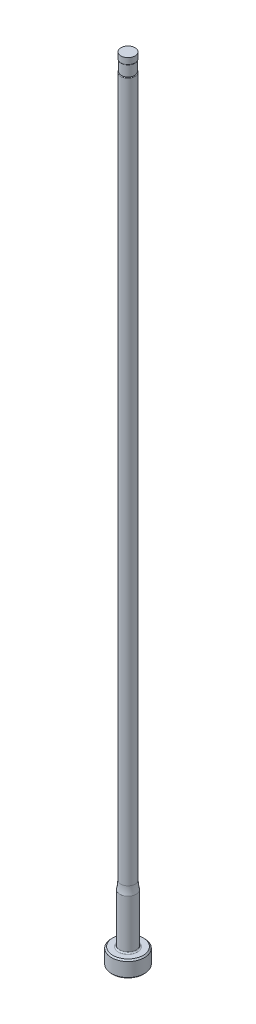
ISO-10303-21;
HEADER;
FILE_DESCRIPTION(('STEP AP214'),'2;1');
FILE_NAME('part.step','',(''),(''),'','','');
FILE_SCHEMA(('AUTOMOTIVE_DESIGN { 1 0 10303 214 1 1 1 1 }'));
ENDSEC;
DATA;
#1=APPLICATION_CONTEXT('core data for automotive mechanical design processes');
#2=APPLICATION_PROTOCOL_DEFINITION('international standard','automotive_design',2000,#1);
#3=PRODUCT_CONTEXT('',#1,'mechanical');
#4=PRODUCT('Part','Part','',(#3));
#5=PRODUCT_RELATED_PRODUCT_CATEGORY('part','',(#4));
#6=PRODUCT_DEFINITION_FORMATION('','',#4);
#7=PRODUCT_DEFINITION_CONTEXT('part definition',#1,'design');
#8=PRODUCT_DEFINITION('design','',#6,#7);
#9=PRODUCT_DEFINITION_SHAPE('','',#8);
#10=(LENGTH_UNIT() NAMED_UNIT(*) SI_UNIT(.MILLI.,.METRE.));
#11=(NAMED_UNIT(*) PLANE_ANGLE_UNIT() SI_UNIT($,.RADIAN.));
#12=(NAMED_UNIT(*) SI_UNIT($,.STERADIAN.) SOLID_ANGLE_UNIT());
#13=UNCERTAINTY_MEASURE_WITH_UNIT(LENGTH_MEASURE(1.E-05),#10,'distance_accuracy_value','');
#14=(GEOMETRIC_REPRESENTATION_CONTEXT(3) GLOBAL_UNCERTAINTY_ASSIGNED_CONTEXT((#13)) GLOBAL_UNIT_ASSIGNED_CONTEXT((#10,
#11,#12)) REPRESENTATION_CONTEXT('',''));
#15=CARTESIAN_POINT('',(0.,0.,0.));
#16=DIRECTION('',(0.,0.,1.));
#17=DIRECTION('',(1.,0.,0.));
#18=AXIS2_PLACEMENT_3D('',#15,#16,#17);
#19=CARTESIAN_POINT('',(0.,259.958771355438,0.));
#20=DIRECTION('',(0.,1.,0.));
#21=DIRECTION('',(0.,0.,1.));
#22=AXIS2_PLACEMENT_3D('',#19,#20,#21);
#23=CYLINDRICAL_SURFACE('',#22,1.38810999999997);
#24=DIRECTION('',(0.,1.,0.));
#25=VECTOR('',#24,1.);
#26=CARTESIAN_POINT('',(-1.28650999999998,259.958771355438,-0.521288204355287));
#27=LINE('',#26,#25);
#28=CARTESIAN_POINT('',(-1.28650999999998,148.973565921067,-0.521288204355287));
#29=VERTEX_POINT('',#28);
#30=CARTESIAN_POINT('',(-1.28650999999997,112.014,-0.521288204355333));
#31=VERTEX_POINT('',#30);
#32=EDGE_CURVE('E66',#29,#31,#27,.F.);
#33=ORIENTED_EDGE('',*,*,#32,.F.);
#34=CARTESIAN_POINT('',(0.,148.973565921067,0.));
#35=DIRECTION('',(0.,1.,0.));
#36=DIRECTION('',(0.,0.,1.));
#37=AXIS2_PLACEMENT_3D('',#34,#35,#36);
#38=CIRCLE('',#37,1.38810999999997);
#39=CARTESIAN_POINT('',(-1.28650999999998,148.973565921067,0.521288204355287));
#40=VERTEX_POINT('',#39);
#41=EDGE_CURVE('E44',#29,#40,#38,.F.);
#42=ORIENTED_EDGE('',*,*,#41,.T.);
#43=DIRECTION('',(0.,1.,0.));
#44=VECTOR('',#43,1.);
#45=CARTESIAN_POINT('',(-1.28650999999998,259.958771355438,0.521288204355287));
#46=LINE('',#45,#44);
#47=CARTESIAN_POINT('',(-1.28650999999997,112.014,0.521288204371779));
#48=VERTEX_POINT('',#47);
#49=EDGE_CURVE('E72',#48,#40,#46,.T.);
#50=ORIENTED_EDGE('',*,*,#49,.F.);
#51=CARTESIAN_POINT('',(-1.28650999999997,112.014,-0.521288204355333));
#52=CARTESIAN_POINT('',(-1.28650942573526,111.988928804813,-0.521284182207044));
#53=CARTESIAN_POINT('',(-1.28680726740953,111.963865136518,-0.520555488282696));
#54=CARTESIAN_POINT('',(-1.28799191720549,111.913826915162,-0.517619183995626));
#55=CARTESIAN_POINT('',(-1.28887900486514,111.888852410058,-0.515410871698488));
#56=CARTESIAN_POINT('',(-1.29243982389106,111.813619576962,-0.506452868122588));
#57=CARTESIAN_POINT('',(-1.29601290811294,111.763650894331,-0.49736839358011));
#58=CARTESIAN_POINT('',(-1.30530992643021,111.665479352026,-0.472434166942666));
#59=CARTESIAN_POINT('',(-1.31103961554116,111.617281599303,-0.456566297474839));
#60=CARTESIAN_POINT('',(-1.32412375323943,111.524513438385,-0.417110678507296));
#61=CARTESIAN_POINT('',(-1.33146964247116,111.479925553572,-0.393563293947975));
#62=CARTESIAN_POINT('',(-1.34350828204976,111.414593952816,-0.349438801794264));
#63=CARTESIAN_POINT('',(-1.34799903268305,111.391780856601,-0.331865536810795));
#64=CARTESIAN_POINT('',(-1.35686421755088,111.34896367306,-0.29352417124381));
#65=CARTESIAN_POINT('',(-1.36123876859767,111.328956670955,-0.272759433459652));
#66=CARTESIAN_POINT('',(-1.36869665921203,111.296112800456,-0.232084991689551));
#67=CARTESIAN_POINT('',(-1.37186978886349,111.282633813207,-0.212714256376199));
#68=CARTESIAN_POINT('',(-1.37757131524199,111.25895318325,-0.171955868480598));
#69=CARTESIAN_POINT('',(-1.38010004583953,111.248749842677,-0.150569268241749));
#70=CARTESIAN_POINT('',(-1.38424028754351,111.232264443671,-0.105984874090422));
#71=CARTESIAN_POINT('',(-1.38584269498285,111.226021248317,-0.0827715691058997));
#72=CARTESIAN_POINT('',(-1.3878558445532,111.218203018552,-0.0355242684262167));
#73=CARTESIAN_POINT('',(-1.38826785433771,111.216623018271,-0.0114911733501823));
#74=CARTESIAN_POINT('',(-1.38787374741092,111.218145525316,0.0326639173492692));
#75=CARTESIAN_POINT('',(-1.38724652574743,111.220560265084,0.0528147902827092));
#76=CARTESIAN_POINT('',(-1.38517272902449,111.228639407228,0.0924056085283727));
#77=CARTESIAN_POINT('',(-1.38372605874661,111.234304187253,0.111845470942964));
#78=CARTESIAN_POINT('',(-1.38015682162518,111.248532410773,0.149590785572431));
#79=CARTESIAN_POINT('',(-1.37803307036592,111.257100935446,0.167894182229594));
#80=CARTESIAN_POINT('',(-1.37329208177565,111.276682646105,0.203060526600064));
#81=CARTESIAN_POINT('',(-1.3706746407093,111.287696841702,0.219922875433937));
#82=CARTESIAN_POINT('',(-1.36363743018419,111.318179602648,0.260714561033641));
#83=CARTESIAN_POINT('',(-1.35900359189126,111.339015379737,0.283587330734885));
#84=CARTESIAN_POINT('',(-1.34954115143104,111.384071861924,0.325660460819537));
#85=CARTESIAN_POINT('',(-1.34471211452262,111.408300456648,0.344852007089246));
#86=CARTESIAN_POINT('',(-1.3331073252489,111.470742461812,0.387781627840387));
#87=CARTESIAN_POINT('',(-1.32644843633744,111.510293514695,0.409600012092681));
#88=CARTESIAN_POINT('',(-1.31433631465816,111.592492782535,0.446935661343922));
#89=CARTESIAN_POINT('',(-1.3088875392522,111.635151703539,0.462429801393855));
#90=CARTESIAN_POINT('',(-1.29848168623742,111.733173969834,0.491004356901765));
#91=CARTESIAN_POINT('',(-1.29398787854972,111.789047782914,0.50251359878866));
#92=CARTESIAN_POINT('',(-1.2895011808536,111.873377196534,0.513856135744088));
#93=CARTESIAN_POINT('',(-1.28838136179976,111.901428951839,0.516650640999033));
#94=CARTESIAN_POINT('',(-1.28688584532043,111.957649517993,0.520362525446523));
#95=CARTESIAN_POINT('',(-1.28650943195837,111.985818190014,0.521281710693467));
#96=CARTESIAN_POINT('',(-1.28650999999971,112.013999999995,0.521288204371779));
#97=B_SPLINE_CURVE_WITH_KNOTS('',3,(#51,#52,#53,#54,#55,#56,#57,#58,#59,#60,#61,#62,#63,#64,#65,
#66,#67,#68,#69,#70,#71,#72,#73,#74,#75,#76,#77,#78,#79,#80,#81,#82,#83,#84,#85,#86,#87,#88,#89,
#90,#91,#92,#93,#94,#95,#96),.UNSPECIFIED.,.F.,.F.,(4,2,2,2,2,2,2,2,2,2,2,2,2,2,2,2,2,2,2,2,2,2,
4),(0.,0.0751855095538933,0.15040671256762,0.30263293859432,0.455268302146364,0.607113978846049,
0.694309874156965,0.781414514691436,0.852578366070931,0.923705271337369,0.99551980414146,
1.06725783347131,1.12787752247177,1.18850425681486,1.2492376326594,1.30999612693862,
1.40332110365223,1.49686681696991,1.63308593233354,1.76979877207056,1.94068119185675,
2.02526314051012,2.10976359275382),.UNSPECIFIED.);
#98=EDGE_CURVE('E74',#31,#48,#97,.T.);
#99=ORIENTED_EDGE('',*,*,#98,.F.);
#100=EDGE_LOOP('',(#33,#42,#50,#99));
#101=FACE_BOUND('',#100,.T.);
#102=CARTESIAN_POINT('',(0.,14.2787642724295,0.));
#103=DIRECTION('',(0.,1.,0.));
#104=DIRECTION('',(0.,0.,1.));
#105=AXIS2_PLACEMENT_3D('',#102,#103,#104);
#106=CIRCLE('',#105,1.38810999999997);
#107=CARTESIAN_POINT('',(0.,14.2787642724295,1.38810999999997));
#108=VERTEX_POINT('',#107);
#109=EDGE_CURVE('E95',#108,#108,#106,.T.);
#110=ORIENTED_EDGE('',*,*,#109,.T.);
#111=EDGE_LOOP('',(#110));
#112=FACE_BOUND('',#111,.T.);
#113=ADVANCED_FACE('F36',(#101,#112),#23,.T.);
#114=CARTESIAN_POINT('',(0.,14.2787642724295,0.));
#115=DIRECTION('',(0.,1.,0.));
#116=DIRECTION('',(0.,0.,1.));
#117=AXIS2_PLACEMENT_3D('',#114,#115,#116);
#118=TOROIDAL_SURFACE('',#117,7.73810999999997,6.35);
#119=CARTESIAN_POINT('',(0.,12.7,0.));
#120=DIRECTION('',(0.,1.,0.));
#121=DIRECTION('',(0.,0.,1.));
#122=AXIS2_PLACEMENT_3D('',#119,#120,#121);
#123=CIRCLE('',#122,1.58749999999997);
#124=CARTESIAN_POINT('',(0.,12.7,1.58749999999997));
#125=VERTEX_POINT('',#124);
#126=EDGE_CURVE('E92',#125,#125,#123,.T.);
#127=ORIENTED_EDGE('',*,*,#126,.T.);
#128=EDGE_LOOP('',(#127));
#129=FACE_BOUND('',#128,.T.);
#130=ORIENTED_EDGE('',*,*,#109,.F.);
#131=EDGE_LOOP('',(#130));
#132=FACE_BOUND('',#131,.T.);
#133=ADVANCED_FACE('F156',(#129,#132),#118,.F.);
#134=CARTESIAN_POINT('',(0.,259.958771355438,0.));
#135=DIRECTION('',(0.,1.,0.));
#136=DIRECTION('',(0.,0.,1.));
#137=AXIS2_PLACEMENT_3D('',#134,#135,#136);
#138=CYLINDRICAL_SURFACE('',#137,1.58749999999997);
#139=CARTESIAN_POINT('',(0.,3.42900000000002,0.));
#140=DIRECTION('',(0.,1.,0.));
#141=DIRECTION('',(0.,0.,1.));
#142=AXIS2_PLACEMENT_3D('',#139,#140,#141);
#143=CIRCLE('',#142,1.58749999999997);
#144=CARTESIAN_POINT('',(0.,3.42900000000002,1.58749999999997));
#145=VERTEX_POINT('',#144);
#146=EDGE_CURVE('E110',#145,#145,#143,.T.);
#147=ORIENTED_EDGE('',*,*,#146,.T.);
#148=EDGE_LOOP('',(#147));
#149=FACE_BOUND('',#148,.T.);
#150=ORIENTED_EDGE('',*,*,#126,.F.);
#151=EDGE_LOOP('',(#150));
#152=FACE_BOUND('',#151,.T.);
#153=ADVANCED_FACE('F153',(#149,#152),#138,.T.);
#154=CARTESIAN_POINT('',(-3.17499999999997,3.175,0.));
#155=DIRECTION('',(0.,1.,0.));
#156=DIRECTION('',(0.,0.,1.));
#157=AXIS2_PLACEMENT_3D('',#154,#155,#156);
#158=PLANE('',#157);
#159=CARTESIAN_POINT('',(0.,3.175,0.));
#160=DIRECTION('',(0.,1.,0.));
#161=DIRECTION('',(0.,0.,1.));
#162=AXIS2_PLACEMENT_3D('',#159,#160,#161);
#163=CIRCLE('',#162,1.84149999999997);
#164=CARTESIAN_POINT('',(0.,3.175,1.84149999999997));
#165=VERTEX_POINT('',#164);
#166=EDGE_CURVE('E78',#165,#165,#163,.F.);
#167=ORIENTED_EDGE('',*,*,#166,.T.);
#168=EDGE_LOOP('',(#167));
#169=FACE_BOUND('',#168,.T.);
#170=CARTESIAN_POINT('',(0.,3.175,0.));
#171=DIRECTION('',(0.,1.,0.));
#172=DIRECTION('',(0.,0.,1.));
#173=AXIS2_PLACEMENT_3D('',#170,#171,#172);
#174=CIRCLE('',#173,2.92099999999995);
#175=CARTESIAN_POINT('',(0.,3.175,2.92099999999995));
#176=VERTEX_POINT('',#175);
#177=EDGE_CURVE('E98',#176,#176,#174,.T.);
#178=ORIENTED_EDGE('',*,*,#177,.T.);
#179=EDGE_LOOP('',(#178));
#180=FACE_BOUND('',#179,.T.);
#181=ADVANCED_FACE('F149',(#169,#180),#158,.T.);
#182=CARTESIAN_POINT('',(0.,259.958771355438,0.));
#183=DIRECTION('',(0.,1.,0.));
#184=DIRECTION('',(0.,0.,1.));
#185=AXIS2_PLACEMENT_3D('',#182,#183,#184);
#186=CYLINDRICAL_SURFACE('',#185,3.17499999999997);
#187=CARTESIAN_POINT('',(0.,2.92100000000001,0.));
#188=DIRECTION('',(0.,1.,0.));
#189=DIRECTION('',(0.,0.,1.));
#190=AXIS2_PLACEMENT_3D('',#187,#188,#189);
#191=CIRCLE('',#190,3.17499999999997);
#192=CARTESIAN_POINT('',(0.,2.92100000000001,3.17499999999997));
#193=VERTEX_POINT('',#192);
#194=EDGE_CURVE('E104',#193,#193,#191,.F.);
#195=ORIENTED_EDGE('',*,*,#194,.T.);
#196=EDGE_LOOP('',(#195));
#197=FACE_BOUND('',#196,.T.);
#198=CARTESIAN_POINT('',(0.,0.254000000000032,0.));
#199=DIRECTION('',(0.,-1.,0.));
#200=DIRECTION('',(0.,0.,-1.));
#201=AXIS2_PLACEMENT_3D('',#198,#199,#200);
#202=CIRCLE('',#201,3.17499999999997);
#203=CARTESIAN_POINT('',(0.,0.254000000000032,-3.17499999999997));
#204=VERTEX_POINT('',#203);
#205=EDGE_CURVE('E101',#204,#204,#202,.F.);
#206=ORIENTED_EDGE('',*,*,#205,.T.);
#207=EDGE_LOOP('',(#206));
#208=FACE_BOUND('',#207,.T.);
#209=ADVANCED_FACE('F145',(#197,#208),#186,.T.);
#210=CARTESIAN_POINT('',(0.,0.,0.));
#211=DIRECTION('',(0.,-1.,0.));
#212=DIRECTION('',(0.,0.,-1.));
#213=AXIS2_PLACEMENT_3D('',#210,#211,#212);
#214=PLANE('',#213);
#215=CARTESIAN_POINT('',(0.,0.,0.));
#216=DIRECTION('',(0.,-1.,0.));
#217=DIRECTION('',(0.,0.,-1.));
#218=AXIS2_PLACEMENT_3D('',#215,#216,#217);
#219=CIRCLE('',#218,2.92099999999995);
#220=CARTESIAN_POINT('',(0.,0.,-2.92099999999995));
#221=VERTEX_POINT('',#220);
#222=EDGE_CURVE('E107',#221,#221,#219,.T.);
#223=ORIENTED_EDGE('',*,*,#222,.T.);
#224=EDGE_LOOP('',(#223));
#225=FACE_BOUND('',#224,.T.);
#226=ADVANCED_FACE('F141',(#225),#214,.T.);
#227=CARTESIAN_POINT('',(0.,3.17499999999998,0.));
#228=DIRECTION('',(0.,-1.,0.));
#229=DIRECTION('',(0.,0.,-1.));
#230=AXIS2_PLACEMENT_3D('',#227,#228,#229);
#231=CONICAL_SURFACE('',#230,2.92099999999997,0.7853981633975);
#232=ORIENTED_EDGE('',*,*,#194,.F.);
#233=EDGE_LOOP('',(#232));
#234=FACE_BOUND('',#233,.T.);
#235=ORIENTED_EDGE('',*,*,#177,.F.);
#236=EDGE_LOOP('',(#235));
#237=FACE_BOUND('',#236,.T.);
#238=ADVANCED_FACE('F144',(#234,#237),#231,.T.);
#239=CARTESIAN_POINT('',(0.,0.254000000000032,0.));
#240=DIRECTION('',(0.,1.,0.));
#241=DIRECTION('',(0.,0.,1.));
#242=AXIS2_PLACEMENT_3D('',#239,#240,#241);
#243=CONICAL_SURFACE('',#242,3.17499999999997,0.785398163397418);
#244=ORIENTED_EDGE('',*,*,#222,.F.);
#245=EDGE_LOOP('',(#244));
#246=FACE_BOUND('',#245,.T.);
#247=ORIENTED_EDGE('',*,*,#205,.F.);
#248=EDGE_LOOP('',(#247));
#249=FACE_BOUND('',#248,.T.);
#250=ADVANCED_FACE('F245',(#246,#249),#243,.T.);
#251=CARTESIAN_POINT('',(0.,3.42900000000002,0.));
#252=DIRECTION('',(0.,1.,0.));
#253=DIRECTION('',(0.,0.,1.));
#254=AXIS2_PLACEMENT_3D('',#251,#252,#253);
#255=TOROIDAL_SURFACE('',#254,1.84149999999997,0.254);
#256=ORIENTED_EDGE('',*,*,#166,.F.);
#257=EDGE_LOOP('',(#256));
#258=FACE_BOUND('',#257,.T.);
#259=ORIENTED_EDGE('',*,*,#146,.F.);
#260=EDGE_LOOP('',(#259));
#261=FACE_BOUND('',#260,.T.);
#262=ADVANCED_FACE('F139',(#258,#261),#255,.F.);
#263=CARTESIAN_POINT('',(0.,153.448281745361,0.));
#264=DIRECTION('',(0.,1.,0.));
#265=DIRECTION('',(0.,0.,1.));
#266=AXIS2_PLACEMENT_3D('',#263,#264,#265);
#267=CYLINDRICAL_SURFACE('',#266,1.28650999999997);
#268=CARTESIAN_POINT('',(0.,151.13,0.));
#269=DIRECTION('',(0.,1.,0.));
#270=DIRECTION('',(0.,0.,1.));
#271=AXIS2_PLACEMENT_3D('',#268,#269,#270);
#272=CIRCLE('',#271,1.28650999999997);
#273=CARTESIAN_POINT('',(0.,151.13,1.28650999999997));
#274=VERTEX_POINT('',#273);
#275=EDGE_CURVE('E71',#274,#274,#272,.T.);
#276=ORIENTED_EDGE('',*,*,#275,.F.);
#277=EDGE_LOOP('',(#276));
#278=FACE_BOUND('',#277,.T.);
#279=CARTESIAN_POINT('',(0.,149.098,0.));
#280=DIRECTION('',(0.,1.,0.));
#281=DIRECTION('',(0.,0.,1.));
#282=AXIS2_PLACEMENT_3D('',#279,#280,#281);
#283=CIRCLE('',#282,1.28650999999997);
#284=CARTESIAN_POINT('',(-1.28650999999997,149.098,0.));
#285=VERTEX_POINT('',#284);
#286=EDGE_CURVE('E89',#285,#285,#283,.T.);
#287=ORIENTED_EDGE('',*,*,#286,.T.);
#288=EDGE_LOOP('',(#287));
#289=FACE_BOUND('',#288,.T.);
#290=ADVANCED_FACE('F136',(#278,#289),#267,.T.);
#291=CARTESIAN_POINT('',(-1.28650999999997,150.114,-3.17499999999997));
#292=DIRECTION('',(1.,0.,0.));
#293=DIRECTION('',(0.,1.,0.));
#294=AXIS2_PLACEMENT_3D('',#291,#292,#293);
#295=PLANE('',#294);
#296=CARTESIAN_POINT('',(-1.28650999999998,148.973565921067,0.521288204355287));
#297=CARTESIAN_POINT('',(-1.28650999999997,148.976543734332,0.521296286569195));
#298=CARTESIAN_POINT('',(-1.28650999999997,148.97951092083,0.521009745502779));
#299=CARTESIAN_POINT('',(-1.28650999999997,148.985314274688,0.519922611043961));
#300=CARTESIAN_POINT('',(-1.28650999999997,148.988151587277,0.519128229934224));
#301=CARTESIAN_POINT('',(-1.28650999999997,148.99428840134,0.516865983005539));
#302=CARTESIAN_POINT('',(-1.28650999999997,148.997545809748,0.515285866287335));
#303=CARTESIAN_POINT('',(-1.28650999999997,149.003773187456,0.511618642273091));
#304=CARTESIAN_POINT('',(-1.28650999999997,149.00674164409,0.509529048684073));
#305=CARTESIAN_POINT('',(-1.28650999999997,149.014061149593,0.50363303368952));
#306=CARTESIAN_POINT('',(-1.28650999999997,149.018183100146,0.49954516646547));
#307=CARTESIAN_POINT('',(-1.28650999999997,149.025782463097,0.490820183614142));
#308=CARTESIAN_POINT('',(-1.28650999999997,149.029258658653,0.486182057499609));
#309=CARTESIAN_POINT('',(-1.28650999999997,149.039007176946,0.471627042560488));
#310=CARTESIAN_POINT('',(-1.28650999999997,149.044482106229,0.461183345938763));
#311=CARTESIAN_POINT('',(-1.28650999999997,149.054043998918,0.439690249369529));
#312=CARTESIAN_POINT('',(-1.28650999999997,149.058126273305,0.42863894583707));
#313=CARTESIAN_POINT('',(-1.28650999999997,149.06562285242,0.405219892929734));
#314=CARTESIAN_POINT('',(-1.28650999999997,149.068944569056,0.392822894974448));
#315=CARTESIAN_POINT('',(-1.28650999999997,149.074742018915,0.367829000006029));
#316=CARTESIAN_POINT('',(-1.28650999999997,149.077216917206,0.355231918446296));
#317=CARTESIAN_POINT('',(-1.28650999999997,149.083717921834,0.317205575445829));
#318=CARTESIAN_POINT('',(-1.28650999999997,149.086799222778,0.291618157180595));
#319=CARTESIAN_POINT('',(-1.28650999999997,149.09153097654,0.24018142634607));
#320=CARTESIAN_POINT('',(-1.28650999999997,149.093172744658,0.214331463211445));
#321=CARTESIAN_POINT('',(-1.28650999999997,149.095602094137,0.162584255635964));
#322=CARTESIAN_POINT('',(-1.28650999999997,149.096389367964,0.13668699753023));
#323=CARTESIAN_POINT('',(-1.28650999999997,149.097321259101,0.0922416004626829));
#324=CARTESIAN_POINT('',(-1.28650999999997,149.097584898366,0.0736953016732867));
#325=CARTESIAN_POINT('',(-1.28650999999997,149.097919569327,0.0367659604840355));
#326=CARTESIAN_POINT('',(-1.28650999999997,149.097992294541,0.0183829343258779));
#327=CARTESIAN_POINT('',(-1.28650999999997,149.098,0.));
#328=B_SPLINE_CURVE_WITH_KNOTS('',3,(#296,#297,#298,#299,#300,#301,#302,#303,#304,#305,#306,
#307,#308,#309,#310,#311,#312,#313,#314,#315,#316,#317,#318,#319,#320,#321,#322,#323,#324,#325,
#326,#327),.UNSPECIFIED.,.F.,.F.,(4,2,2,2,2,2,2,2,2,2,2,2,2,2,2,4),(0.,0.00890253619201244,
0.0176982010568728,0.0284990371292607,0.0393536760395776,0.056671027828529,0.0740206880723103,
0.109198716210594,0.144494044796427,0.182950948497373,0.221445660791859,0.298673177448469,
0.376363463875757,0.454081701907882,0.509725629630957,0.564874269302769),.UNSPECIFIED.);
#329=EDGE_CURVE('E77',#40,#285,#328,.T.);
#330=ORIENTED_EDGE('',*,*,#329,.T.);
#331=CARTESIAN_POINT('',(-1.28650999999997,149.098,0.));
#332=CARTESIAN_POINT('',(-1.28650999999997,149.097985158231,-0.0211574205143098));
#333=CARTESIAN_POINT('',(-1.28650999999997,149.097892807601,-0.0423161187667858));
#334=CARTESIAN_POINT('',(-1.28650999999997,149.097447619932,-0.0846465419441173));
#335=CARTESIAN_POINT('',(-1.28650999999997,149.097094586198,-0.105818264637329));
#336=CARTESIAN_POINT('',(-1.28650999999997,149.096021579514,-0.148180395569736));
#337=CARTESIAN_POINT('',(-1.28650999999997,149.095301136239,-0.169370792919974));
#338=CARTESIAN_POINT('',(-1.28650999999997,149.093275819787,-0.211719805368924));
#339=CARTESIAN_POINT('',(-1.28650999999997,149.091971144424,-0.232878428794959));
#340=CARTESIAN_POINT('',(-1.28650999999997,149.088936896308,-0.269239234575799));
#341=CARTESIAN_POINT('',(-1.28650999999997,149.087426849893,-0.284459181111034));
#342=CARTESIAN_POINT('',(-1.28650999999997,149.083747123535,-0.314836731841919));
#343=CARTESIAN_POINT('',(-1.28650999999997,149.081576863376,-0.329994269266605));
#344=CARTESIAN_POINT('',(-1.28650999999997,149.076226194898,-0.36070634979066));
#345=CARTESIAN_POINT('',(-1.28650999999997,149.073011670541,-0.376255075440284));
#346=CARTESIAN_POINT('',(-1.28650999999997,149.065175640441,-0.406994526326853));
#347=CARTESIAN_POINT('',(-1.28650999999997,149.060556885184,-0.422185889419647));
#348=CARTESIAN_POINT('',(-1.28650999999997,149.052067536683,-0.444158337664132));
#349=CARTESIAN_POINT('',(-1.28650999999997,149.049027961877,-0.451257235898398));
#350=CARTESIAN_POINT('',(-1.28650999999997,149.042272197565,-0.465143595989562));
#351=CARTESIAN_POINT('',(-1.28650999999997,149.038555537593,-0.47193083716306));
#352=CARTESIAN_POINT('',(-1.28650999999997,149.031166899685,-0.483496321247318));
#353=CARTESIAN_POINT('',(-1.28650999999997,149.027669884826,-0.48838498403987));
#354=CARTESIAN_POINT('',(-1.28650999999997,149.020009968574,-0.497611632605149));
#355=CARTESIAN_POINT('',(-1.28650999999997,149.01584924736,-0.501951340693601));
#356=CARTESIAN_POINT('',(-1.28650999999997,149.008744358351,-0.507990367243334));
#357=CARTESIAN_POINT('',(-1.28650999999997,149.006073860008,-0.510009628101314));
#358=CARTESIAN_POINT('',(-1.28650999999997,149.000472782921,-0.513654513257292));
#359=CARTESIAN_POINT('',(-1.28650999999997,148.997542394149,-0.515280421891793));
#360=CARTESIAN_POINT('',(-1.28650999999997,148.991862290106,-0.517827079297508));
#361=CARTESIAN_POINT('',(-1.28650999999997,148.989142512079,-0.518813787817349));
#362=CARTESIAN_POINT('',(-1.28650999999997,148.983578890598,-0.520316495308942));
#363=CARTESIAN_POINT('',(-1.28650999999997,148.980735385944,-0.520833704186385));
#364=CARTESIAN_POINT('',(-1.28650999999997,148.976439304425,-0.521223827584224));
#365=CARTESIAN_POINT('',(-1.28650999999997,148.975002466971,-0.52128961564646));
#366=CARTESIAN_POINT('',(-1.28650999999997,148.973565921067,-0.521288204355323));
#367=B_SPLINE_CURVE_WITH_KNOTS('',3,(#331,#332,#333,#334,#335,#336,#337,#338,#339,#340,#341,
#342,#343,#344,#345,#346,#347,#348,#349,#350,#351,#352,#353,#354,#355,#356,#357,#358,#359,#360,
#361,#362,#363,#364,#365,#366),.UNSPECIFIED.,.F.,.F.,(4,2,2,2,2,2,2,2,2,2,2,2,2,2,2,2,2,4),(0.,
0.0634741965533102,0.126996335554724,0.190599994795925,0.254182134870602,0.300056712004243,
0.345971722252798,0.393570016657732,0.441075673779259,0.464219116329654,0.48737870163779,
0.505372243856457,0.523307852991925,0.533326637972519,0.543338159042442,0.551983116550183,
0.560605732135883,0.564915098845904),.UNSPECIFIED.);
#368=EDGE_CURVE('E58',#285,#29,#367,.T.);
#369=ORIENTED_EDGE('',*,*,#368,.T.);
#370=ORIENTED_EDGE('',*,*,#32,.T.);
#371=DIRECTION('',(0.,0.,1.));
#372=VECTOR('',#371,1.);
#373=CARTESIAN_POINT('',(-1.28650999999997,112.014,-3.17499999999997));
#374=LINE('',#373,#372);
#375=EDGE_CURVE('E70',#31,#48,#374,.T.);
#376=ORIENTED_EDGE('',*,*,#375,.T.);
#377=ORIENTED_EDGE('',*,*,#49,.T.);
#378=EDGE_LOOP('',(#330,#369,#370,#376,#377));
#379=FACE_BOUND('',#378,.T.);
#380=ADVANCED_FACE('F68',(#379),#295,.F.);
#381=CARTESIAN_POINT('',(-4.46150999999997,112.014,-3.17499999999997));
#382=DIRECTION('',(0.,0.,1.));
#383=DIRECTION('',(1.,0.,0.));
#384=AXIS2_PLACEMENT_3D('',#381,#382,#383);
#385=CYLINDRICAL_SURFACE('',#384,3.175);
#386=ORIENTED_EDGE('',*,*,#375,.F.);
#387=ORIENTED_EDGE('',*,*,#98,.T.);
#388=EDGE_LOOP('',(#386,#387));
#389=FACE_BOUND('',#388,.T.);
#390=ADVANCED_FACE('F80',(#389),#385,.F.);
#391=CARTESIAN_POINT('',(0.,152.687735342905,0.));
#392=DIRECTION('',(0.,1.,0.));
#393=DIRECTION('',(0.,0.,1.));
#394=AXIS2_PLACEMENT_3D('',#391,#392,#393);
#395=CYLINDRICAL_SURFACE('',#394,1.36905999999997);
#396=CARTESIAN_POINT('',(0.,151.24896721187,0.));
#397=DIRECTION('',(0.,-1.,0.));
#398=DIRECTION('',(0.,0.,-1.));
#399=AXIS2_PLACEMENT_3D('',#396,#397,#398);
#400=CIRCLE('',#399,1.36905999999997);
#401=CARTESIAN_POINT('',(0.,151.24896721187,-1.36905999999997));
#402=VERTEX_POINT('',#401);
#403=EDGE_CURVE('E11',#402,#402,#400,.F.);
#404=ORIENTED_EDGE('',*,*,#403,.T.);
#405=EDGE_LOOP('',(#404));
#406=FACE_BOUND('',#405,.T.);
#407=CARTESIAN_POINT('',(0.,152.4,0.));
#408=DIRECTION('',(0.,1.,0.));
#409=DIRECTION('',(0.,0.,1.));
#410=AXIS2_PLACEMENT_3D('',#407,#408,#409);
#411=CIRCLE('',#410,1.36905999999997);
#412=CARTESIAN_POINT('',(0.,152.4,1.36905999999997));
#413=VERTEX_POINT('',#412);
#414=EDGE_CURVE('E81',#413,#413,#411,.T.);
#415=ORIENTED_EDGE('',*,*,#414,.F.);
#416=EDGE_LOOP('',(#415));
#417=FACE_BOUND('',#416,.T.);
#418=ADVANCED_FACE('F133',(#406,#417),#395,.T.);
#419=CARTESIAN_POINT('',(-1.38810999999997,152.4,0.));
#420=DIRECTION('',(0.,1.,0.));
#421=DIRECTION('',(0.,0.,1.));
#422=AXIS2_PLACEMENT_3D('',#419,#420,#421);
#423=PLANE('',#422);
#424=ORIENTED_EDGE('',*,*,#414,.T.);
#425=EDGE_LOOP('',(#424));
#426=FACE_BOUND('',#425,.T.);
#427=ADVANCED_FACE('F177',(#426),#423,.T.);
#428=CARTESIAN_POINT('',(0.,148.973565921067,0.));
#429=DIRECTION('',(0.,1.,0.));
#430=DIRECTION('',(0.,0.,1.));
#431=AXIS2_PLACEMENT_3D('',#428,#429,#430);
#432=TOROIDAL_SURFACE('',#431,1.26110999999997,0.127);
#433=ORIENTED_EDGE('',*,*,#329,.F.);
#434=ORIENTED_EDGE('',*,*,#41,.F.);
#435=ORIENTED_EDGE('',*,*,#368,.F.);
#436=ORIENTED_EDGE('',*,*,#286,.F.);
#437=EDGE_LOOP('',(#433,#434,#435,#436));
#438=FACE_BOUND('',#437,.T.);
#439=ADVANCED_FACE('F209',(#438),#432,.T.);
#440=CARTESIAN_POINT('',(0.,151.24896721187,0.));
#441=DIRECTION('',(0.,-1.,0.));
#442=DIRECTION('',(0.,0.,-1.));
#443=AXIS2_PLACEMENT_3D('',#440,#441,#442);
#444=TOROIDAL_SURFACE('',#443,1.24205999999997,0.127);
#445=ORIENTED_EDGE('',*,*,#275,.T.);
#446=EDGE_LOOP('',(#445));
#447=FACE_BOUND('',#446,.T.);
#448=ORIENTED_EDGE('',*,*,#403,.F.);
#449=EDGE_LOOP('',(#448));
#450=FACE_BOUND('',#449,.T.);
#451=ADVANCED_FACE('F38',(#447,#450),#444,.T.);
#452=CLOSED_SHELL('',(#113,#133,#153,#181,#209,#226,#238,#250,#262,#290,#380,#390,#418,#427,
#439,#451));
#453=MANIFOLD_SOLID_BREP('B2',#452);
#454=ADVANCED_BREP_SHAPE_REPRESENTATION('',(#18,#453),#14);
#455=SHAPE_DEFINITION_REPRESENTATION(#9,#454);
ENDSEC;
END-ISO-10303-21;
